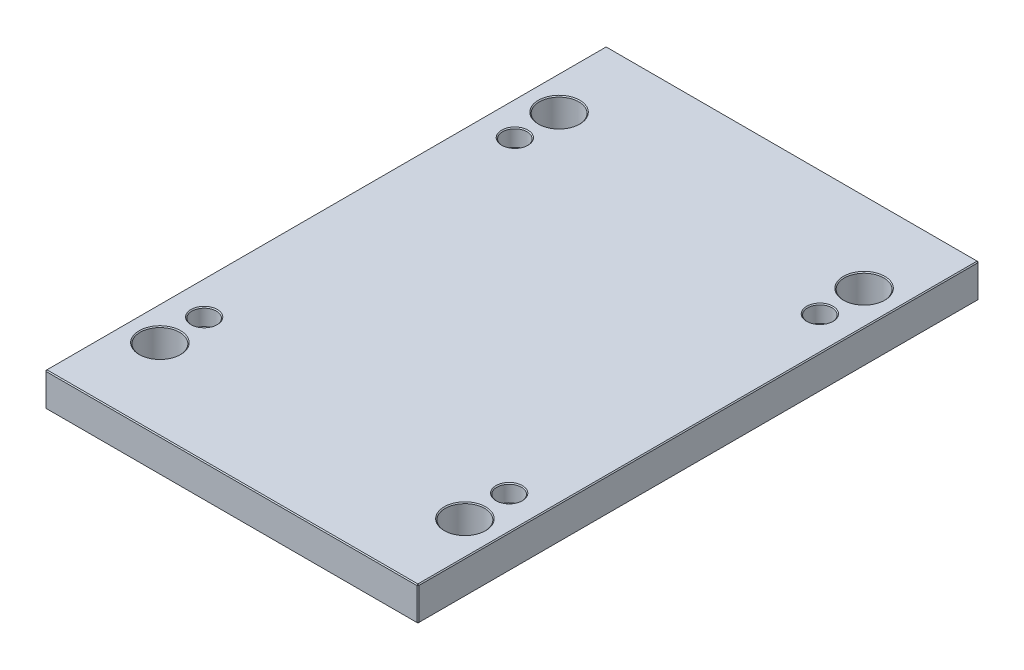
ISO-10303-21;
HEADER;
FILE_DESCRIPTION(('STEP AP214'),'2;1');
FILE_NAME('part.step','',(''),(''),'','','');
FILE_SCHEMA(('AUTOMOTIVE_DESIGN { 1 0 10303 214 1 1 1 1 }'));
ENDSEC;
DATA;
#1=APPLICATION_CONTEXT('core data for automotive mechanical design processes');
#2=APPLICATION_PROTOCOL_DEFINITION('international standard','automotive_design',2000,#1);
#3=PRODUCT_CONTEXT('',#1,'mechanical');
#4=PRODUCT('Part','Part','',(#3));
#5=PRODUCT_RELATED_PRODUCT_CATEGORY('part','',(#4));
#6=PRODUCT_DEFINITION_FORMATION('','',#4);
#7=PRODUCT_DEFINITION_CONTEXT('part definition',#1,'design');
#8=PRODUCT_DEFINITION('design','',#6,#7);
#9=PRODUCT_DEFINITION_SHAPE('','',#8);
#10=(LENGTH_UNIT() NAMED_UNIT(*) SI_UNIT(.MILLI.,.METRE.));
#11=(NAMED_UNIT(*) PLANE_ANGLE_UNIT() SI_UNIT($,.RADIAN.));
#12=(NAMED_UNIT(*) SI_UNIT($,.STERADIAN.) SOLID_ANGLE_UNIT());
#13=UNCERTAINTY_MEASURE_WITH_UNIT(LENGTH_MEASURE(1.E-05),#10,'distance_accuracy_value','');
#14=(GEOMETRIC_REPRESENTATION_CONTEXT(3) GLOBAL_UNCERTAINTY_ASSIGNED_CONTEXT((#13)) GLOBAL_UNIT_ASSIGNED_CONTEXT((#10,
#11,#12)) REPRESENTATION_CONTEXT('',''));
#15=CARTESIAN_POINT('',(0.,0.,0.));
#16=DIRECTION('',(0.,0.,1.));
#17=DIRECTION('',(1.,0.,0.));
#18=AXIS2_PLACEMENT_3D('',#15,#16,#17);
#19=CARTESIAN_POINT('',(-198.,36.,298.));
#20=DIRECTION('',(1.,0.,0.));
#21=DIRECTION('',(0.,0.,-1.));
#22=AXIS2_PLACEMENT_3D('',#19,#20,#21);
#23=PLANE('',#22);
#24=DIRECTION('',(0.,-1.,0.));
#25=VECTOR('',#24,1.);
#26=CARTESIAN_POINT('',(-198.,36.,-297.));
#27=LINE('',#26,#25);
#28=CARTESIAN_POINT('',(-198.,35.,-297.));
#29=VERTEX_POINT('',#28);
#30=CARTESIAN_POINT('',(-198.,1.,-297.));
#31=VERTEX_POINT('',#30);
#32=EDGE_CURVE('E115',#29,#31,#27,.T.);
#33=ORIENTED_EDGE('',*,*,#32,.T.);
#34=DIRECTION('',(0.,0.,1.));
#35=VECTOR('',#34,1.);
#36=CARTESIAN_POINT('',(-198.,1.,298.));
#37=LINE('',#36,#35);
#38=CARTESIAN_POINT('',(-198.,1.,297.));
#39=VERTEX_POINT('',#38);
#40=EDGE_CURVE('E111',#31,#39,#37,.T.);
#41=ORIENTED_EDGE('',*,*,#40,.T.);
#42=DIRECTION('',(0.,1.,0.));
#43=VECTOR('',#42,1.);
#44=CARTESIAN_POINT('',(-198.,36.,297.));
#45=LINE('',#44,#43);
#46=CARTESIAN_POINT('',(-198.,35.,297.));
#47=VERTEX_POINT('',#46);
#48=EDGE_CURVE('E104',#39,#47,#45,.T.);
#49=ORIENTED_EDGE('',*,*,#48,.T.);
#50=DIRECTION('',(0.,0.,-1.));
#51=VECTOR('',#50,1.);
#52=CARTESIAN_POINT('',(-198.,35.,-298.));
#53=LINE('',#52,#51);
#54=EDGE_CURVE('E108',#47,#29,#53,.T.);
#55=ORIENTED_EDGE('',*,*,#54,.T.);
#56=EDGE_LOOP('',(#33,#41,#49,#55));
#57=FACE_BOUND('',#56,.T.);
#58=ADVANCED_FACE('F16',(#57),#23,.F.);
#59=CARTESIAN_POINT('',(198.,36.,298.));
#60=DIRECTION('',(0.,0.,-1.));
#61=DIRECTION('',(-1.,0.,0.));
#62=AXIS2_PLACEMENT_3D('',#59,#60,#61);
#63=PLANE('',#62);
#64=DIRECTION('',(-1.,0.,0.));
#65=VECTOR('',#64,1.);
#66=CARTESIAN_POINT('',(-198.,35.,298.));
#67=LINE('',#66,#65);
#68=CARTESIAN_POINT('',(197.,35.,298.));
#69=VERTEX_POINT('',#68);
#70=CARTESIAN_POINT('',(-197.,35.,298.));
#71=VERTEX_POINT('',#70);
#72=EDGE_CURVE('E170',#69,#71,#67,.T.);
#73=ORIENTED_EDGE('',*,*,#72,.T.);
#74=DIRECTION('',(0.,-1.,0.));
#75=VECTOR('',#74,1.);
#76=CARTESIAN_POINT('',(-197.,36.,298.));
#77=LINE('',#76,#75);
#78=CARTESIAN_POINT('',(-197.,1.,298.));
#79=VERTEX_POINT('',#78);
#80=EDGE_CURVE('E123',#71,#79,#77,.T.);
#81=ORIENTED_EDGE('',*,*,#80,.T.);
#82=DIRECTION('',(1.,0.,0.));
#83=VECTOR('',#82,1.);
#84=CARTESIAN_POINT('',(198.,1.,298.));
#85=LINE('',#84,#83);
#86=CARTESIAN_POINT('',(197.,1.,298.));
#87=VERTEX_POINT('',#86);
#88=EDGE_CURVE('E174',#79,#87,#85,.T.);
#89=ORIENTED_EDGE('',*,*,#88,.T.);
#90=DIRECTION('',(0.,1.,0.));
#91=VECTOR('',#90,1.);
#92=CARTESIAN_POINT('',(197.,36.,298.));
#93=LINE('',#92,#91);
#94=EDGE_CURVE('E172',#87,#69,#93,.T.);
#95=ORIENTED_EDGE('',*,*,#94,.T.);
#96=EDGE_LOOP('',(#73,#81,#89,#95));
#97=FACE_BOUND('',#96,.T.);
#98=ADVANCED_FACE('F413',(#97),#63,.F.);
#99=CARTESIAN_POINT('',(198.,36.,298.));
#100=DIRECTION('',(-1.,0.,0.));
#101=DIRECTION('',(0.,0.,1.));
#102=AXIS2_PLACEMENT_3D('',#99,#100,#101);
#103=PLANE('',#102);
#104=DIRECTION('',(0.,0.,-1.));
#105=VECTOR('',#104,1.);
#106=CARTESIAN_POINT('',(198.,1.,298.));
#107=LINE('',#106,#105);
#108=CARTESIAN_POINT('',(198.,1.,297.));
#109=VERTEX_POINT('',#108);
#110=CARTESIAN_POINT('',(198.,1.,-297.));
#111=VERTEX_POINT('',#110);
#112=EDGE_CURVE('E165',#109,#111,#107,.T.);
#113=ORIENTED_EDGE('',*,*,#112,.T.);
#114=DIRECTION('',(0.,1.,0.));
#115=VECTOR('',#114,1.);
#116=CARTESIAN_POINT('',(198.,36.,-297.));
#117=LINE('',#116,#115);
#118=CARTESIAN_POINT('',(198.,35.,-297.));
#119=VERTEX_POINT('',#118);
#120=EDGE_CURVE('E167',#111,#119,#117,.T.);
#121=ORIENTED_EDGE('',*,*,#120,.T.);
#122=DIRECTION('',(0.,0.,1.));
#123=VECTOR('',#122,1.);
#124=CARTESIAN_POINT('',(198.,35.,298.));
#125=LINE('',#124,#123);
#126=CARTESIAN_POINT('',(198.,35.,297.));
#127=VERTEX_POINT('',#126);
#128=EDGE_CURVE('E161',#119,#127,#125,.T.);
#129=ORIENTED_EDGE('',*,*,#128,.T.);
#130=DIRECTION('',(0.,-1.,0.));
#131=VECTOR('',#130,1.);
#132=CARTESIAN_POINT('',(198.,36.,297.));
#133=LINE('',#132,#131);
#134=EDGE_CURVE('E163',#127,#109,#133,.T.);
#135=ORIENTED_EDGE('',*,*,#134,.T.);
#136=EDGE_LOOP('',(#113,#121,#129,#135));
#137=FACE_BOUND('',#136,.T.);
#138=ADVANCED_FACE('F406',(#137),#103,.F.);
#139=CARTESIAN_POINT('',(198.,36.,-298.));
#140=DIRECTION('',(0.,0.,1.));
#141=DIRECTION('',(1.,0.,0.));
#142=AXIS2_PLACEMENT_3D('',#139,#140,#141);
#143=PLANE('',#142);
#144=DIRECTION('',(0.,-1.,0.));
#145=VECTOR('',#144,1.);
#146=CARTESIAN_POINT('',(197.,36.,-298.));
#147=LINE('',#146,#145);
#148=CARTESIAN_POINT('',(197.,35.,-298.));
#149=VERTEX_POINT('',#148);
#150=CARTESIAN_POINT('',(197.,1.,-298.));
#151=VERTEX_POINT('',#150);
#152=EDGE_CURVE('E154',#149,#151,#147,.T.);
#153=ORIENTED_EDGE('',*,*,#152,.T.);
#154=DIRECTION('',(-1.,0.,0.));
#155=VECTOR('',#154,1.);
#156=CARTESIAN_POINT('',(198.,1.,-298.));
#157=LINE('',#156,#155);
#158=CARTESIAN_POINT('',(-197.,1.,-298.));
#159=VERTEX_POINT('',#158);
#160=EDGE_CURVE('E159',#151,#159,#157,.T.);
#161=ORIENTED_EDGE('',*,*,#160,.T.);
#162=DIRECTION('',(0.,1.,0.));
#163=VECTOR('',#162,1.);
#164=CARTESIAN_POINT('',(-197.,36.,-298.));
#165=LINE('',#164,#163);
#166=CARTESIAN_POINT('',(-197.,35.,-298.));
#167=VERTEX_POINT('',#166);
#168=EDGE_CURVE('E156',#159,#167,#165,.T.);
#169=ORIENTED_EDGE('',*,*,#168,.T.);
#170=DIRECTION('',(1.,0.,0.));
#171=VECTOR('',#170,1.);
#172=CARTESIAN_POINT('',(198.,35.,-298.));
#173=LINE('',#172,#171);
#174=EDGE_CURVE('E152',#167,#149,#173,.T.);
#175=ORIENTED_EDGE('',*,*,#174,.T.);
#176=EDGE_LOOP('',(#153,#161,#169,#175));
#177=FACE_BOUND('',#176,.T.);
#178=ADVANCED_FACE('F431',(#177),#143,.F.);
#179=CARTESIAN_POINT('',(0.,36.,0.));
#180=DIRECTION('',(0.,1.,0.));
#181=DIRECTION('',(0.,0.,1.));
#182=AXIS2_PLACEMENT_3D('',#179,#180,#181);
#183=PLANE('',#182);
#184=CARTESIAN_POINT('',(-162.,36.,212.));
#185=DIRECTION('',(0.,1.,0.));
#186=DIRECTION('',(0.,0.,1.));
#187=AXIS2_PLACEMENT_3D('',#184,#185,#186);
#188=CIRCLE('',#187,22.);
#189=CARTESIAN_POINT('',(-162.,36.,234.));
#190=VERTEX_POINT('',#189);
#191=EDGE_CURVE('E317',#190,#190,#188,.F.);
#192=ORIENTED_EDGE('',*,*,#191,.T.);
#193=EDGE_LOOP('',(#192));
#194=FACE_BOUND('',#193,.T.);
#195=CARTESIAN_POINT('',(162.,36.,212.));
#196=DIRECTION('',(0.,1.,0.));
#197=DIRECTION('',(0.,0.,1.));
#198=AXIS2_PLACEMENT_3D('',#195,#196,#197);
#199=CIRCLE('',#198,22.);
#200=CARTESIAN_POINT('',(162.,36.,234.));
#201=VERTEX_POINT('',#200);
#202=EDGE_CURVE('E314',#201,#201,#199,.F.);
#203=ORIENTED_EDGE('',*,*,#202,.T.);
#204=EDGE_LOOP('',(#203));
#205=FACE_BOUND('',#204,.T.);
#206=CARTESIAN_POINT('',(162.,36.,-212.));
#207=DIRECTION('',(0.,1.,0.));
#208=DIRECTION('',(0.,0.,1.));
#209=AXIS2_PLACEMENT_3D('',#206,#207,#208);
#210=CIRCLE('',#209,22.);
#211=CARTESIAN_POINT('',(162.,36.,-190.));
#212=VERTEX_POINT('',#211);
#213=EDGE_CURVE('E311',#212,#212,#210,.F.);
#214=ORIENTED_EDGE('',*,*,#213,.T.);
#215=EDGE_LOOP('',(#214));
#216=FACE_BOUND('',#215,.T.);
#217=CARTESIAN_POINT('',(-162.,36.,-212.));
#218=DIRECTION('',(0.,1.,0.));
#219=DIRECTION('',(0.,0.,1.));
#220=AXIS2_PLACEMENT_3D('',#217,#218,#219);
#221=CIRCLE('',#220,22.);
#222=CARTESIAN_POINT('',(-162.,36.,-190.));
#223=VERTEX_POINT('',#222);
#224=EDGE_CURVE('E308',#223,#223,#221,.F.);
#225=ORIENTED_EDGE('',*,*,#224,.T.);
#226=EDGE_LOOP('',(#225));
#227=FACE_BOUND('',#226,.T.);
#228=CARTESIAN_POINT('',(-162.,36.,165.));
#229=DIRECTION('',(0.,1.,0.));
#230=DIRECTION('',(0.,0.,1.));
#231=AXIS2_PLACEMENT_3D('',#228,#229,#230);
#232=CIRCLE('',#231,14.0000000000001);
#233=CARTESIAN_POINT('',(-162.,36.,179.));
#234=VERTEX_POINT('',#233);
#235=EDGE_CURVE('E290',#234,#234,#232,.F.);
#236=ORIENTED_EDGE('',*,*,#235,.T.);
#237=EDGE_LOOP('',(#236));
#238=FACE_BOUND('',#237,.T.);
#239=CARTESIAN_POINT('',(162.,36.,165.));
#240=DIRECTION('',(0.,1.,0.));
#241=DIRECTION('',(0.,0.,1.));
#242=AXIS2_PLACEMENT_3D('',#239,#240,#241);
#243=CIRCLE('',#242,14.0000000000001);
#244=CARTESIAN_POINT('',(162.,36.,179.));
#245=VERTEX_POINT('',#244);
#246=EDGE_CURVE('E287',#245,#245,#243,.F.);
#247=ORIENTED_EDGE('',*,*,#246,.T.);
#248=EDGE_LOOP('',(#247));
#249=FACE_BOUND('',#248,.T.);
#250=CARTESIAN_POINT('',(162.,36.,-165.));
#251=DIRECTION('',(0.,1.,0.));
#252=DIRECTION('',(0.,0.,1.));
#253=AXIS2_PLACEMENT_3D('',#250,#251,#252);
#254=CIRCLE('',#253,14.0000000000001);
#255=CARTESIAN_POINT('',(162.,36.,-151.));
#256=VERTEX_POINT('',#255);
#257=EDGE_CURVE('E284',#256,#256,#254,.F.);
#258=ORIENTED_EDGE('',*,*,#257,.T.);
#259=EDGE_LOOP('',(#258));
#260=FACE_BOUND('',#259,.T.);
#261=CARTESIAN_POINT('',(-162.,36.,-165.));
#262=DIRECTION('',(0.,1.,0.));
#263=DIRECTION('',(0.,0.,1.));
#264=AXIS2_PLACEMENT_3D('',#261,#262,#263);
#265=CIRCLE('',#264,14.);
#266=CARTESIAN_POINT('',(-162.,36.,-151.));
#267=VERTEX_POINT('',#266);
#268=EDGE_CURVE('E281',#267,#267,#265,.F.);
#269=ORIENTED_EDGE('',*,*,#268,.T.);
#270=EDGE_LOOP('',(#269));
#271=FACE_BOUND('',#270,.T.);
#272=DIRECTION('',(0.,0.,-1.));
#273=VECTOR('',#272,1.);
#274=CARTESIAN_POINT('',(197.,36.,-298.));
#275=LINE('',#274,#273);
#276=CARTESIAN_POINT('',(197.,36.,297.));
#277=VERTEX_POINT('',#276);
#278=CARTESIAN_POINT('',(197.,36.,-297.));
#279=VERTEX_POINT('',#278);
#280=EDGE_CURVE('E31',#277,#279,#275,.T.);
#281=ORIENTED_EDGE('',*,*,#280,.T.);
#282=DIRECTION('',(-1.,0.,0.));
#283=VECTOR('',#282,1.);
#284=CARTESIAN_POINT('',(-198.,36.,-297.));
#285=LINE('',#284,#283);
#286=CARTESIAN_POINT('',(-197.,36.,-297.));
#287=VERTEX_POINT('',#286);
#288=EDGE_CURVE('E190',#279,#287,#285,.T.);
#289=ORIENTED_EDGE('',*,*,#288,.T.);
#290=DIRECTION('',(0.,0.,1.));
#291=VECTOR('',#290,1.);
#292=CARTESIAN_POINT('',(-197.,36.,298.));
#293=LINE('',#292,#291);
#294=CARTESIAN_POINT('',(-197.,36.,297.));
#295=VERTEX_POINT('',#294);
#296=EDGE_CURVE('E186',#287,#295,#293,.T.);
#297=ORIENTED_EDGE('',*,*,#296,.T.);
#298=DIRECTION('',(1.,0.,0.));
#299=VECTOR('',#298,1.);
#300=CARTESIAN_POINT('',(198.,36.,297.));
#301=LINE('',#300,#299);
#302=EDGE_CURVE('E36',#295,#277,#301,.T.);
#303=ORIENTED_EDGE('',*,*,#302,.T.);
#304=EDGE_LOOP('',(#281,#289,#297,#303));
#305=FACE_BOUND('',#304,.T.);
#306=ADVANCED_FACE('F357',(#194,#205,#216,#227,#238,#249,#260,#271,#305),#183,.T.);
#307=CARTESIAN_POINT('',(0.,0.,0.));
#308=DIRECTION('',(0.,1.,0.));
#309=DIRECTION('',(0.,0.,1.));
#310=AXIS2_PLACEMENT_3D('',#307,#308,#309);
#311=PLANE('',#310);
#312=CARTESIAN_POINT('',(-162.,0.,212.));
#313=DIRECTION('',(0.,1.,0.));
#314=DIRECTION('',(0.,0.,1.));
#315=AXIS2_PLACEMENT_3D('',#312,#313,#314);
#316=CIRCLE('',#315,22.);
#317=CARTESIAN_POINT('',(-162.,0.,234.));
#318=VERTEX_POINT('',#317);
#319=EDGE_CURVE('E329',#318,#318,#316,.T.);
#320=ORIENTED_EDGE('',*,*,#319,.T.);
#321=EDGE_LOOP('',(#320));
#322=FACE_BOUND('',#321,.T.);
#323=CARTESIAN_POINT('',(162.,0.,212.));
#324=DIRECTION('',(0.,1.,0.));
#325=DIRECTION('',(0.,0.,1.));
#326=AXIS2_PLACEMENT_3D('',#323,#324,#325);
#327=CIRCLE('',#326,22.);
#328=CARTESIAN_POINT('',(162.,0.,234.));
#329=VERTEX_POINT('',#328);
#330=EDGE_CURVE('E326',#329,#329,#327,.T.);
#331=ORIENTED_EDGE('',*,*,#330,.T.);
#332=EDGE_LOOP('',(#331));
#333=FACE_BOUND('',#332,.T.);
#334=CARTESIAN_POINT('',(162.,0.,-212.));
#335=DIRECTION('',(0.,1.,0.));
#336=DIRECTION('',(0.,0.,1.));
#337=AXIS2_PLACEMENT_3D('',#334,#335,#336);
#338=CIRCLE('',#337,22.);
#339=CARTESIAN_POINT('',(162.,0.,-190.));
#340=VERTEX_POINT('',#339);
#341=EDGE_CURVE('E323',#340,#340,#338,.T.);
#342=ORIENTED_EDGE('',*,*,#341,.T.);
#343=EDGE_LOOP('',(#342));
#344=FACE_BOUND('',#343,.T.);
#345=CARTESIAN_POINT('',(-162.,0.,-212.));
#346=DIRECTION('',(0.,1.,0.));
#347=DIRECTION('',(0.,0.,1.));
#348=AXIS2_PLACEMENT_3D('',#345,#346,#347);
#349=CIRCLE('',#348,22.);
#350=CARTESIAN_POINT('',(-162.,0.,-190.));
#351=VERTEX_POINT('',#350);
#352=EDGE_CURVE('E320',#351,#351,#349,.T.);
#353=ORIENTED_EDGE('',*,*,#352,.T.);
#354=EDGE_LOOP('',(#353));
#355=FACE_BOUND('',#354,.T.);
#356=CARTESIAN_POINT('',(162.,0.,-165.));
#357=DIRECTION('',(0.,1.,0.));
#358=DIRECTION('',(0.,0.,1.));
#359=AXIS2_PLACEMENT_3D('',#356,#357,#358);
#360=CIRCLE('',#359,10.);
#361=CARTESIAN_POINT('',(162.,0.,-155.));
#362=VERTEX_POINT('',#361);
#363=EDGE_CURVE('E263',#362,#362,#360,.T.);
#364=ORIENTED_EDGE('',*,*,#363,.T.);
#365=EDGE_LOOP('',(#364));
#366=FACE_BOUND('',#365,.T.);
#367=CARTESIAN_POINT('',(162.,0.,165.));
#368=DIRECTION('',(0.,1.,0.));
#369=DIRECTION('',(0.,0.,1.));
#370=AXIS2_PLACEMENT_3D('',#367,#368,#369);
#371=CIRCLE('',#370,10.);
#372=CARTESIAN_POINT('',(162.,0.,175.));
#373=VERTEX_POINT('',#372);
#374=EDGE_CURVE('E260',#373,#373,#371,.T.);
#375=ORIENTED_EDGE('',*,*,#374,.T.);
#376=EDGE_LOOP('',(#375));
#377=FACE_BOUND('',#376,.T.);
#378=CARTESIAN_POINT('',(-162.,0.,165.));
#379=DIRECTION('',(0.,1.,0.));
#380=DIRECTION('',(0.,0.,1.));
#381=AXIS2_PLACEMENT_3D('',#378,#379,#380);
#382=CIRCLE('',#381,10.);
#383=CARTESIAN_POINT('',(-162.,0.,175.));
#384=VERTEX_POINT('',#383);
#385=EDGE_CURVE('E257',#384,#384,#382,.T.);
#386=ORIENTED_EDGE('',*,*,#385,.T.);
#387=EDGE_LOOP('',(#386));
#388=FACE_BOUND('',#387,.T.);
#389=CARTESIAN_POINT('',(-162.,0.,-165.));
#390=DIRECTION('',(0.,1.,0.));
#391=DIRECTION('',(0.,0.,1.));
#392=AXIS2_PLACEMENT_3D('',#389,#390,#391);
#393=CIRCLE('',#392,10.);
#394=CARTESIAN_POINT('',(-162.,0.,-155.));
#395=VERTEX_POINT('',#394);
#396=EDGE_CURVE('E192',#395,#395,#393,.T.);
#397=ORIENTED_EDGE('',*,*,#396,.T.);
#398=EDGE_LOOP('',(#397));
#399=FACE_BOUND('',#398,.T.);
#400=DIRECTION('',(0.,0.,1.));
#401=VECTOR('',#400,1.);
#402=CARTESIAN_POINT('',(197.,0.,0.));
#403=LINE('',#402,#401);
#404=CARTESIAN_POINT('',(197.,0.,-297.));
#405=VERTEX_POINT('',#404);
#406=CARTESIAN_POINT('',(197.,0.,297.));
#407=VERTEX_POINT('',#406);
#408=EDGE_CURVE('E177',#405,#407,#403,.T.);
#409=ORIENTED_EDGE('',*,*,#408,.T.);
#410=DIRECTION('',(-1.,0.,0.));
#411=VECTOR('',#410,1.);
#412=CARTESIAN_POINT('',(0.,0.,297.));
#413=LINE('',#412,#411);
#414=CARTESIAN_POINT('',(-197.,0.,297.));
#415=VERTEX_POINT('',#414);
#416=EDGE_CURVE('E183',#407,#415,#413,.T.);
#417=ORIENTED_EDGE('',*,*,#416,.T.);
#418=DIRECTION('',(0.,0.,-1.));
#419=VECTOR('',#418,1.);
#420=CARTESIAN_POINT('',(-197.,0.,0.));
#421=LINE('',#420,#419);
#422=CARTESIAN_POINT('',(-197.,0.,-297.));
#423=VERTEX_POINT('',#422);
#424=EDGE_CURVE('E181',#415,#423,#421,.T.);
#425=ORIENTED_EDGE('',*,*,#424,.T.);
#426=DIRECTION('',(1.,0.,0.));
#427=VECTOR('',#426,1.);
#428=CARTESIAN_POINT('',(0.,0.,-297.));
#429=LINE('',#428,#427);
#430=EDGE_CURVE('E179',#423,#405,#429,.T.);
#431=ORIENTED_EDGE('',*,*,#430,.T.);
#432=EDGE_LOOP('',(#409,#417,#425,#431));
#433=FACE_BOUND('',#432,.T.);
#434=ADVANCED_FACE('F353',(#322,#333,#344,#355,#366,#377,#388,#399,#433),#311,.F.);
#435=CARTESIAN_POINT('',(198.,36.,297.));
#436=DIRECTION('',(-0.707106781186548,0.,-0.707106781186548));
#437=DIRECTION('',(0.,-1.,0.));
#438=AXIS2_PLACEMENT_3D('',#435,#436,#437);
#439=PLANE('',#438);
#440=DIRECTION('',(-0.707106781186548,0.,0.707106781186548));
#441=VECTOR('',#440,1.);
#442=CARTESIAN_POINT('',(197.,35.,298.));
#443=LINE('',#442,#441);
#444=EDGE_CURVE('E141',#69,#127,#443,.F.);
#445=ORIENTED_EDGE('',*,*,#444,.F.);
#446=ORIENTED_EDGE('',*,*,#94,.F.);
#447=DIRECTION('',(0.707106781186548,0.,-0.707106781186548));
#448=VECTOR('',#447,1.);
#449=CARTESIAN_POINT('',(197.,1.,298.));
#450=LINE('',#449,#448);
#451=EDGE_CURVE('E144',#109,#87,#450,.F.);
#452=ORIENTED_EDGE('',*,*,#451,.F.);
#453=ORIENTED_EDGE('',*,*,#134,.F.);
#454=EDGE_LOOP('',(#445,#446,#452,#453));
#455=FACE_BOUND('',#454,.T.);
#456=ADVANCED_FACE('F356',(#455),#439,.F.);
#457=CARTESIAN_POINT('',(197.,35.,298.));
#458=DIRECTION('',(0.577350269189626,0.577350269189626,0.577350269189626));
#459=DIRECTION('',(0.707106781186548,0.,-0.707106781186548));
#460=AXIS2_PLACEMENT_3D('',#457,#458,#459);
#461=PLANE('',#460);
#462=DIRECTION('',(0.,-0.707106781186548,0.707106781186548));
#463=VECTOR('',#462,1.);
#464=CARTESIAN_POINT('',(197.,35.,298.));
#465=LINE('',#464,#463);
#466=EDGE_CURVE('E235',#69,#277,#465,.F.);
#467=ORIENTED_EDGE('',*,*,#466,.F.);
#468=ORIENTED_EDGE('',*,*,#444,.T.);
#469=DIRECTION('',(-0.707106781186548,0.707106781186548,0.));
#470=VECTOR('',#469,1.);
#471=CARTESIAN_POINT('',(197.5,35.5,297.));
#472=LINE('',#471,#470);
#473=EDGE_CURVE('E237',#277,#127,#472,.F.);
#474=ORIENTED_EDGE('',*,*,#473,.F.);
#475=EDGE_LOOP('',(#467,#468,#474));
#476=FACE_BOUND('',#475,.T.);
#477=ADVANCED_FACE('F419',(#476),#461,.T.);
#478=CARTESIAN_POINT('',(197.,1.,298.));
#479=DIRECTION('',(0.577350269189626,-0.577350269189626,0.577350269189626));
#480=DIRECTION('',(0.707106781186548,0.,-0.707106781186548));
#481=AXIS2_PLACEMENT_3D('',#478,#479,#480);
#482=PLANE('',#481);
#483=DIRECTION('',(-0.707106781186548,-0.707106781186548,0.));
#484=VECTOR('',#483,1.);
#485=CARTESIAN_POINT('',(197.5,0.5,297.));
#486=LINE('',#485,#484);
#487=EDGE_CURVE('E229',#109,#407,#486,.T.);
#488=ORIENTED_EDGE('',*,*,#487,.F.);
#489=ORIENTED_EDGE('',*,*,#451,.T.);
#490=DIRECTION('',(0.,0.707106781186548,0.707106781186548));
#491=VECTOR('',#490,1.);
#492=CARTESIAN_POINT('',(197.,1.,298.));
#493=LINE('',#492,#491);
#494=EDGE_CURVE('E232',#407,#87,#493,.T.);
#495=ORIENTED_EDGE('',*,*,#494,.F.);
#496=EDGE_LOOP('',(#488,#489,#495));
#497=FACE_BOUND('',#496,.T.);
#498=ADVANCED_FACE('F378',(#497),#482,.T.);
#499=CARTESIAN_POINT('',(197.,36.,0.));
#500=DIRECTION('',(0.707106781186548,0.707106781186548,0.));
#501=DIRECTION('',(0.,0.,1.));
#502=AXIS2_PLACEMENT_3D('',#499,#500,#501);
#503=PLANE('',#502);
#504=ORIENTED_EDGE('',*,*,#473,.T.);
#505=ORIENTED_EDGE('',*,*,#128,.F.);
#506=DIRECTION('',(0.707106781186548,-0.707106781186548,0.));
#507=VECTOR('',#506,1.);
#508=CARTESIAN_POINT('',(198.,35.,-297.));
#509=LINE('',#508,#507);
#510=EDGE_CURVE('E224',#279,#119,#509,.T.);
#511=ORIENTED_EDGE('',*,*,#510,.F.);
#512=ORIENTED_EDGE('',*,*,#280,.F.);
#513=EDGE_LOOP('',(#504,#505,#511,#512));
#514=FACE_BOUND('',#513,.T.);
#515=ADVANCED_FACE('F421',(#514),#503,.T.);
#516=CARTESIAN_POINT('',(0.,36.,297.));
#517=DIRECTION('',(0.,0.707106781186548,0.707106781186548));
#518=DIRECTION('',(-1.,0.,0.));
#519=AXIS2_PLACEMENT_3D('',#516,#517,#518);
#520=PLANE('',#519);
#521=ORIENTED_EDGE('',*,*,#466,.T.);
#522=ORIENTED_EDGE('',*,*,#302,.F.);
#523=DIRECTION('',(0.,0.707106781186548,-0.707106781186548));
#524=VECTOR('',#523,1.);
#525=CARTESIAN_POINT('',(-197.,35.5,297.5));
#526=LINE('',#525,#524);
#527=EDGE_CURVE('E127',#71,#295,#526,.T.);
#528=ORIENTED_EDGE('',*,*,#527,.F.);
#529=ORIENTED_EDGE('',*,*,#72,.F.);
#530=EDGE_LOOP('',(#521,#522,#528,#529));
#531=FACE_BOUND('',#530,.T.);
#532=ADVANCED_FACE('F416',(#531),#520,.T.);
#533=CARTESIAN_POINT('',(-197.,36.,298.));
#534=DIRECTION('',(0.707106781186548,0.,-0.707106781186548));
#535=DIRECTION('',(0.,-1.,0.));
#536=AXIS2_PLACEMENT_3D('',#533,#534,#535);
#537=PLANE('',#536);
#538=DIRECTION('',(0.707106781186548,0.,0.707106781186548));
#539=VECTOR('',#538,1.);
#540=CARTESIAN_POINT('',(-197.,1.,298.));
#541=LINE('',#540,#539);
#542=EDGE_CURVE('E128',#79,#39,#541,.F.);
#543=ORIENTED_EDGE('',*,*,#542,.F.);
#544=ORIENTED_EDGE('',*,*,#80,.F.);
#545=DIRECTION('',(-0.707106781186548,0.,-0.707106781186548));
#546=VECTOR('',#545,1.);
#547=CARTESIAN_POINT('',(-198.,35.,297.));
#548=LINE('',#547,#546);
#549=EDGE_CURVE('E119',#47,#71,#548,.F.);
#550=ORIENTED_EDGE('',*,*,#549,.F.);
#551=ORIENTED_EDGE('',*,*,#48,.F.);
#552=EDGE_LOOP('',(#543,#544,#550,#551));
#553=FACE_BOUND('',#552,.T.);
#554=ADVANCED_FACE('F121',(#553),#537,.F.);
#555=CARTESIAN_POINT('',(198.,1.,298.));
#556=DIRECTION('',(0.,0.707106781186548,-0.707106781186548));
#557=DIRECTION('',(1.,0.,0.));
#558=AXIS2_PLACEMENT_3D('',#555,#556,#557);
#559=PLANE('',#558);
#560=ORIENTED_EDGE('',*,*,#494,.T.);
#561=ORIENTED_EDGE('',*,*,#88,.F.);
#562=DIRECTION('',(0.,-0.707106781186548,-0.707106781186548));
#563=VECTOR('',#562,1.);
#564=CARTESIAN_POINT('',(-197.,1.,298.));
#565=LINE('',#564,#563);
#566=EDGE_CURVE('E220',#415,#79,#565,.F.);
#567=ORIENTED_EDGE('',*,*,#566,.F.);
#568=ORIENTED_EDGE('',*,*,#416,.F.);
#569=EDGE_LOOP('',(#560,#561,#567,#568));
#570=FACE_BOUND('',#569,.T.);
#571=ADVANCED_FACE('F383',(#570),#559,.F.);
#572=CARTESIAN_POINT('',(198.,1.,298.));
#573=DIRECTION('',(-0.707106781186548,0.707106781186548,0.));
#574=DIRECTION('',(0.,0.,-1.));
#575=AXIS2_PLACEMENT_3D('',#572,#573,#574);
#576=PLANE('',#575);
#577=ORIENTED_EDGE('',*,*,#487,.T.);
#578=ORIENTED_EDGE('',*,*,#408,.F.);
#579=DIRECTION('',(0.707106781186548,0.707106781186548,0.));
#580=VECTOR('',#579,1.);
#581=CARTESIAN_POINT('',(197.5,0.500000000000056,-297.));
#582=LINE('',#581,#580);
#583=EDGE_CURVE('E217',#111,#405,#582,.F.);
#584=ORIENTED_EDGE('',*,*,#583,.F.);
#585=ORIENTED_EDGE('',*,*,#112,.F.);
#586=EDGE_LOOP('',(#577,#578,#584,#585));
#587=FACE_BOUND('',#586,.T.);
#588=ADVANCED_FACE('F376',(#587),#576,.F.);
#589=CARTESIAN_POINT('',(197.,36.,-298.));
#590=DIRECTION('',(-0.707106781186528,0.,0.707106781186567));
#591=DIRECTION('',(0.,-1.,0.));
#592=AXIS2_PLACEMENT_3D('',#589,#590,#591);
#593=PLANE('',#592);
#594=DIRECTION('',(0.707106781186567,0.,0.707106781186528));
#595=VECTOR('',#594,1.);
#596=CARTESIAN_POINT('',(198.,35.,-297.));
#597=LINE('',#596,#595);
#598=EDGE_CURVE('E226',#119,#149,#597,.F.);
#599=ORIENTED_EDGE('',*,*,#598,.F.);
#600=ORIENTED_EDGE('',*,*,#120,.F.);
#601=DIRECTION('',(-0.707106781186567,0.,-0.707106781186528));
#602=VECTOR('',#601,1.);
#603=CARTESIAN_POINT('',(197.,1.,-298.));
#604=LINE('',#603,#602);
#605=EDGE_CURVE('E214',#151,#111,#604,.F.);
#606=ORIENTED_EDGE('',*,*,#605,.F.);
#607=ORIENTED_EDGE('',*,*,#152,.F.);
#608=EDGE_LOOP('',(#599,#600,#606,#607));
#609=FACE_BOUND('',#608,.T.);
#610=ADVANCED_FACE('F403',(#609),#593,.F.);
#611=CARTESIAN_POINT('',(198.,35.,-297.));
#612=DIRECTION('',(0.577350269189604,0.577350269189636,-0.577350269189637));
#613=DIRECTION('',(0.,0.707106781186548,0.707106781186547));
#614=AXIS2_PLACEMENT_3D('',#611,#612,#613);
#615=PLANE('',#614);
#616=ORIENTED_EDGE('',*,*,#510,.T.);
#617=ORIENTED_EDGE('',*,*,#598,.T.);
#618=DIRECTION('',(0.,0.707106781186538,0.707106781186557));
#619=VECTOR('',#618,1.);
#620=CARTESIAN_POINT('',(197.,35.5,-297.5));
#621=LINE('',#620,#619);
#622=EDGE_CURVE('E135',#279,#149,#621,.F.);
#623=ORIENTED_EDGE('',*,*,#622,.F.);
#624=EDGE_LOOP('',(#616,#617,#623));
#625=FACE_BOUND('',#624,.T.);
#626=ADVANCED_FACE('F425',(#625),#615,.T.);
#627=CARTESIAN_POINT('',(-198.,35.,297.));
#628=DIRECTION('',(-0.577350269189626,0.577350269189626,0.577350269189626));
#629=DIRECTION('',(0.707106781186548,0.,0.707106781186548));
#630=AXIS2_PLACEMENT_3D('',#627,#628,#629);
#631=PLANE('',#630);
#632=ORIENTED_EDGE('',*,*,#549,.T.);
#633=ORIENTED_EDGE('',*,*,#527,.T.);
#634=DIRECTION('',(-0.707106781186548,-0.707106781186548,0.));
#635=VECTOR('',#634,1.);
#636=CARTESIAN_POINT('',(-198.,35.,297.));
#637=LINE('',#636,#635);
#638=EDGE_CURVE('E131',#47,#295,#637,.F.);
#639=ORIENTED_EDGE('',*,*,#638,.F.);
#640=EDGE_LOOP('',(#632,#633,#639));
#641=FACE_BOUND('',#640,.T.);
#642=ADVANCED_FACE('F132',(#641),#631,.T.);
#643=CARTESIAN_POINT('',(-197.,1.,298.));
#644=DIRECTION('',(-0.577350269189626,-0.577350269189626,0.577350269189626));
#645=DIRECTION('',(0.707106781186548,0.,0.707106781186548));
#646=AXIS2_PLACEMENT_3D('',#643,#644,#645);
#647=PLANE('',#646);
#648=ORIENTED_EDGE('',*,*,#566,.T.);
#649=ORIENTED_EDGE('',*,*,#542,.T.);
#650=DIRECTION('',(-0.707106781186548,0.707106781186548,0.));
#651=VECTOR('',#650,1.);
#652=CARTESIAN_POINT('',(-197.5,0.5,297.));
#653=LINE('',#652,#651);
#654=EDGE_CURVE('E136',#415,#39,#653,.T.);
#655=ORIENTED_EDGE('',*,*,#654,.F.);
#656=EDGE_LOOP('',(#648,#649,#655));
#657=FACE_BOUND('',#656,.T.);
#658=ADVANCED_FACE('F386',(#657),#647,.T.);
#659=CARTESIAN_POINT('',(197.,1.,-298.));
#660=DIRECTION('',(0.577350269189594,-0.577350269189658,-0.577350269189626));
#661=DIRECTION('',(0.,0.707106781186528,-0.707106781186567));
#662=AXIS2_PLACEMENT_3D('',#659,#660,#661);
#663=PLANE('',#662);
#664=ORIENTED_EDGE('',*,*,#605,.T.);
#665=ORIENTED_EDGE('',*,*,#583,.T.);
#666=DIRECTION('',(0.,-0.707106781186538,0.707106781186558));
#667=VECTOR('',#666,1.);
#668=CARTESIAN_POINT('',(197.,1.,-298.));
#669=LINE('',#668,#667);
#670=EDGE_CURVE('E207',#151,#405,#669,.T.);
#671=ORIENTED_EDGE('',*,*,#670,.F.);
#672=EDGE_LOOP('',(#664,#665,#671));
#673=FACE_BOUND('',#672,.T.);
#674=ADVANCED_FACE('F397',(#673),#663,.T.);
#675=CARTESIAN_POINT('',(0.,36.,-297.));
#676=DIRECTION('',(0.,0.707106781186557,-0.707106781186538));
#677=DIRECTION('',(1.,0.,0.));
#678=AXIS2_PLACEMENT_3D('',#675,#676,#677);
#679=PLANE('',#678);
#680=ORIENTED_EDGE('',*,*,#622,.T.);
#681=ORIENTED_EDGE('',*,*,#174,.F.);
#682=DIRECTION('',(0.,-0.707106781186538,-0.707106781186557));
#683=VECTOR('',#682,1.);
#684=CARTESIAN_POINT('',(-197.,35.,-298.));
#685=LINE('',#684,#683);
#686=EDGE_CURVE('E204',#287,#167,#685,.T.);
#687=ORIENTED_EDGE('',*,*,#686,.F.);
#688=ORIENTED_EDGE('',*,*,#288,.F.);
#689=EDGE_LOOP('',(#680,#681,#687,#688));
#690=FACE_BOUND('',#689,.T.);
#691=ADVANCED_FACE('F429',(#690),#679,.T.);
#692=CARTESIAN_POINT('',(-197.,36.,0.));
#693=DIRECTION('',(-0.707106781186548,0.707106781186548,0.));
#694=DIRECTION('',(0.,0.,-1.));
#695=AXIS2_PLACEMENT_3D('',#692,#693,#694);
#696=PLANE('',#695);
#697=ORIENTED_EDGE('',*,*,#638,.T.);
#698=ORIENTED_EDGE('',*,*,#296,.F.);
#699=DIRECTION('',(0.707106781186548,0.707106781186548,0.));
#700=VECTOR('',#699,1.);
#701=CARTESIAN_POINT('',(-197.5,35.5,-297.));
#702=LINE('',#701,#700);
#703=EDGE_CURVE('E139',#29,#287,#702,.T.);
#704=ORIENTED_EDGE('',*,*,#703,.F.);
#705=ORIENTED_EDGE('',*,*,#54,.F.);
#706=EDGE_LOOP('',(#697,#698,#704,#705));
#707=FACE_BOUND('',#706,.T.);
#708=ADVANCED_FACE('F138',(#707),#696,.T.);
#709=CARTESIAN_POINT('',(-198.,1.,298.));
#710=DIRECTION('',(0.707106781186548,0.707106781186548,0.));
#711=DIRECTION('',(0.,0.,1.));
#712=AXIS2_PLACEMENT_3D('',#709,#710,#711);
#713=PLANE('',#712);
#714=ORIENTED_EDGE('',*,*,#654,.T.);
#715=ORIENTED_EDGE('',*,*,#40,.F.);
#716=DIRECTION('',(0.707106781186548,-0.707106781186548,1.17611407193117E-13));
#717=VECTOR('',#716,1.);
#718=CARTESIAN_POINT('',(-198.,1.,-297.));
#719=LINE('',#718,#717);
#720=EDGE_CURVE('E200',#423,#31,#719,.F.);
#721=ORIENTED_EDGE('',*,*,#720,.F.);
#722=ORIENTED_EDGE('',*,*,#424,.F.);
#723=EDGE_LOOP('',(#714,#715,#721,#722));
#724=FACE_BOUND('',#723,.T.);
#725=ADVANCED_FACE('F388',(#724),#713,.F.);
#726=CARTESIAN_POINT('',(198.,1.,-298.));
#727=DIRECTION('',(0.,0.707106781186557,0.707106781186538));
#728=DIRECTION('',(-1.,0.,0.));
#729=AXIS2_PLACEMENT_3D('',#726,#727,#728);
#730=PLANE('',#729);
#731=ORIENTED_EDGE('',*,*,#670,.T.);
#732=ORIENTED_EDGE('',*,*,#430,.F.);
#733=DIRECTION('',(0.,0.707106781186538,-0.707106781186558));
#734=VECTOR('',#733,1.);
#735=CARTESIAN_POINT('',(-197.,0.50000000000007,-297.5));
#736=LINE('',#735,#734);
#737=EDGE_CURVE('E197',#159,#423,#736,.F.);
#738=ORIENTED_EDGE('',*,*,#737,.F.);
#739=ORIENTED_EDGE('',*,*,#160,.F.);
#740=EDGE_LOOP('',(#731,#732,#738,#739));
#741=FACE_BOUND('',#740,.T.);
#742=ADVANCED_FACE('F392',(#741),#730,.F.);
#743=CARTESIAN_POINT('',(-197.,35.,-298.));
#744=DIRECTION('',(-0.577350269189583,0.577350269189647,-0.577350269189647));
#745=DIRECTION('',(0.,0.707106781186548,0.707106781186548));
#746=AXIS2_PLACEMENT_3D('',#743,#744,#745);
#747=PLANE('',#746);
#748=ORIENTED_EDGE('',*,*,#703,.T.);
#749=ORIENTED_EDGE('',*,*,#686,.T.);
#750=DIRECTION('',(0.707106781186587,0.,-0.707106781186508));
#751=VECTOR('',#750,1.);
#752=CARTESIAN_POINT('',(-197.,35.,-298.));
#753=LINE('',#752,#751);
#754=EDGE_CURVE('E195',#29,#167,#753,.T.);
#755=ORIENTED_EDGE('',*,*,#754,.F.);
#756=EDGE_LOOP('',(#748,#749,#755));
#757=FACE_BOUND('',#756,.T.);
#758=ADVANCED_FACE('F460',(#757),#747,.T.);
#759=CARTESIAN_POINT('',(-198.,1.,-297.));
#760=DIRECTION('',(-0.577350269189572,-0.577350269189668,-0.577350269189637));
#761=DIRECTION('',(0.,0.707106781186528,-0.707106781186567));
#762=AXIS2_PLACEMENT_3D('',#759,#760,#761);
#763=PLANE('',#762);
#764=ORIENTED_EDGE('',*,*,#737,.T.);
#765=ORIENTED_EDGE('',*,*,#720,.T.);
#766=DIRECTION('',(-0.707106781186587,0.,0.707106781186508));
#767=VECTOR('',#766,1.);
#768=CARTESIAN_POINT('',(-198.,1.,-297.));
#769=LINE('',#768,#767);
#770=EDGE_CURVE('E193',#159,#31,#769,.T.);
#771=ORIENTED_EDGE('',*,*,#770,.F.);
#772=EDGE_LOOP('',(#764,#765,#771));
#773=FACE_BOUND('',#772,.T.);
#774=ADVANCED_FACE('F456',(#773),#763,.T.);
#775=CARTESIAN_POINT('',(-198.,36.,-297.));
#776=DIRECTION('',(0.707106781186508,0.,0.707106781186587));
#777=DIRECTION('',(0.,-1.,0.));
#778=AXIS2_PLACEMENT_3D('',#775,#776,#777);
#779=PLANE('',#778);
#780=ORIENTED_EDGE('',*,*,#754,.T.);
#781=ORIENTED_EDGE('',*,*,#168,.F.);
#782=ORIENTED_EDGE('',*,*,#770,.T.);
#783=ORIENTED_EDGE('',*,*,#32,.F.);
#784=EDGE_LOOP('',(#780,#781,#782,#783));
#785=FACE_BOUND('',#784,.T.);
#786=ADVANCED_FACE('F452',(#785),#779,.F.);
#787=CARTESIAN_POINT('',(-162.,18.,-165.));
#788=DIRECTION('',(0.,1.,0.));
#789=DIRECTION('',(0.,0.,1.));
#790=AXIS2_PLACEMENT_3D('',#787,#788,#789);
#791=CYLINDRICAL_SURFACE('',#790,13.);
#792=CARTESIAN_POINT('',(-162.,35.,-165.));
#793=DIRECTION('',(0.,1.,0.));
#794=DIRECTION('',(0.,0.,1.));
#795=AXIS2_PLACEMENT_3D('',#792,#793,#794);
#796=CIRCLE('',#795,13.);
#797=CARTESIAN_POINT('',(-162.,35.,-152.));
#798=VERTEX_POINT('',#797);
#799=EDGE_CURVE('E299',#798,#798,#796,.T.);
#800=ORIENTED_EDGE('',*,*,#799,.T.);
#801=EDGE_LOOP('',(#800));
#802=FACE_BOUND('',#801,.T.);
#803=CARTESIAN_POINT('',(-162.,18.,-165.));
#804=DIRECTION('',(0.,1.,0.));
#805=DIRECTION('',(0.,0.,1.));
#806=AXIS2_PLACEMENT_3D('',#803,#804,#805);
#807=CIRCLE('',#806,13.);
#808=CARTESIAN_POINT('',(-162.,18.,-152.));
#809=VERTEX_POINT('',#808);
#810=EDGE_CURVE('E147',#809,#809,#807,.T.);
#811=ORIENTED_EDGE('',*,*,#810,.F.);
#812=EDGE_LOOP('',(#811));
#813=FACE_BOUND('',#812,.T.);
#814=ADVANCED_FACE('F455',(#802,#813),#791,.F.);
#815=CARTESIAN_POINT('',(-162.,18.,-165.));
#816=DIRECTION('',(0.,1.,0.));
#817=DIRECTION('',(0.,0.,1.));
#818=AXIS2_PLACEMENT_3D('',#815,#816,#817);
#819=PLANE('',#818);
#820=CARTESIAN_POINT('',(-162.,18.,-165.));
#821=DIRECTION('',(0.,1.,0.));
#822=DIRECTION('',(0.,0.,1.));
#823=AXIS2_PLACEMENT_3D('',#820,#821,#822);
#824=CIRCLE('',#823,9.);
#825=CARTESIAN_POINT('',(-162.,18.,-156.));
#826=VERTEX_POINT('',#825);
#827=EDGE_CURVE('E251',#826,#826,#824,.T.);
#828=ORIENTED_EDGE('',*,*,#827,.F.);
#829=EDGE_LOOP('',(#828));
#830=FACE_BOUND('',#829,.T.);
#831=ORIENTED_EDGE('',*,*,#810,.T.);
#832=EDGE_LOOP('',(#831));
#833=FACE_BOUND('',#832,.T.);
#834=ADVANCED_FACE('F602',(#830,#833),#819,.T.);
#835=CARTESIAN_POINT('',(162.,18.,-165.));
#836=DIRECTION('',(0.,1.,0.));
#837=DIRECTION('',(0.,0.,1.));
#838=AXIS2_PLACEMENT_3D('',#835,#836,#837);
#839=CYLINDRICAL_SURFACE('',#838,13.);
#840=CARTESIAN_POINT('',(162.,35.,-165.));
#841=DIRECTION('',(0.,1.,0.));
#842=DIRECTION('',(0.,0.,1.));
#843=AXIS2_PLACEMENT_3D('',#840,#841,#842);
#844=CIRCLE('',#843,13.);
#845=CARTESIAN_POINT('',(162.,35.,-152.));
#846=VERTEX_POINT('',#845);
#847=EDGE_CURVE('E296',#846,#846,#844,.T.);
#848=ORIENTED_EDGE('',*,*,#847,.T.);
#849=EDGE_LOOP('',(#848));
#850=FACE_BOUND('',#849,.T.);
#851=CARTESIAN_POINT('',(162.,18.,-165.));
#852=DIRECTION('',(0.,1.,0.));
#853=DIRECTION('',(0.,0.,1.));
#854=AXIS2_PLACEMENT_3D('',#851,#852,#853);
#855=CIRCLE('',#854,13.);
#856=CARTESIAN_POINT('',(162.,18.,-152.));
#857=VERTEX_POINT('',#856);
#858=EDGE_CURVE('E630',#857,#857,#855,.T.);
#859=ORIENTED_EDGE('',*,*,#858,.F.);
#860=EDGE_LOOP('',(#859));
#861=FACE_BOUND('',#860,.T.);
#862=ADVANCED_FACE('F598',(#850,#861),#839,.F.);
#863=CARTESIAN_POINT('',(162.,18.,-165.));
#864=DIRECTION('',(0.,1.,0.));
#865=DIRECTION('',(0.,0.,1.));
#866=AXIS2_PLACEMENT_3D('',#863,#864,#865);
#867=PLANE('',#866);
#868=CARTESIAN_POINT('',(162.,18.,-165.));
#869=DIRECTION('',(0.,1.,0.));
#870=DIRECTION('',(0.,0.,1.));
#871=AXIS2_PLACEMENT_3D('',#868,#869,#870);
#872=CIRCLE('',#871,9.);
#873=CARTESIAN_POINT('',(162.,18.,-156.));
#874=VERTEX_POINT('',#873);
#875=EDGE_CURVE('E248',#874,#874,#872,.T.);
#876=ORIENTED_EDGE('',*,*,#875,.F.);
#877=EDGE_LOOP('',(#876));
#878=FACE_BOUND('',#877,.T.);
#879=ORIENTED_EDGE('',*,*,#858,.T.);
#880=EDGE_LOOP('',(#879));
#881=FACE_BOUND('',#880,.T.);
#882=ADVANCED_FACE('F594',(#878,#881),#867,.T.);
#883=CARTESIAN_POINT('',(162.,18.,165.));
#884=DIRECTION('',(0.,1.,0.));
#885=DIRECTION('',(0.,0.,1.));
#886=AXIS2_PLACEMENT_3D('',#883,#884,#885);
#887=CYLINDRICAL_SURFACE('',#886,13.);
#888=CARTESIAN_POINT('',(162.,35.,165.));
#889=DIRECTION('',(0.,1.,0.));
#890=DIRECTION('',(0.,0.,1.));
#891=AXIS2_PLACEMENT_3D('',#888,#889,#890);
#892=CIRCLE('',#891,13.);
#893=CARTESIAN_POINT('',(162.,35.,178.));
#894=VERTEX_POINT('',#893);
#895=EDGE_CURVE('E293',#894,#894,#892,.T.);
#896=ORIENTED_EDGE('',*,*,#895,.T.);
#897=EDGE_LOOP('',(#896));
#898=FACE_BOUND('',#897,.T.);
#899=CARTESIAN_POINT('',(162.,18.,165.));
#900=DIRECTION('',(0.,1.,0.));
#901=DIRECTION('',(0.,0.,1.));
#902=AXIS2_PLACEMENT_3D('',#899,#900,#901);
#903=CIRCLE('',#902,13.);
#904=CARTESIAN_POINT('',(162.,18.,178.));
#905=VERTEX_POINT('',#904);
#906=EDGE_CURVE('E632',#905,#905,#903,.T.);
#907=ORIENTED_EDGE('',*,*,#906,.F.);
#908=EDGE_LOOP('',(#907));
#909=FACE_BOUND('',#908,.T.);
#910=ADVANCED_FACE('F597',(#898,#909),#887,.F.);
#911=CARTESIAN_POINT('',(162.,18.,165.));
#912=DIRECTION('',(0.,1.,0.));
#913=DIRECTION('',(0.,0.,1.));
#914=AXIS2_PLACEMENT_3D('',#911,#912,#913);
#915=PLANE('',#914);
#916=CARTESIAN_POINT('',(162.,18.,165.));
#917=DIRECTION('',(0.,1.,0.));
#918=DIRECTION('',(0.,0.,1.));
#919=AXIS2_PLACEMENT_3D('',#916,#917,#918);
#920=CIRCLE('',#919,9.);
#921=CARTESIAN_POINT('',(162.,18.,174.));
#922=VERTEX_POINT('',#921);
#923=EDGE_CURVE('E245',#922,#922,#920,.T.);
#924=ORIENTED_EDGE('',*,*,#923,.F.);
#925=EDGE_LOOP('',(#924));
#926=FACE_BOUND('',#925,.T.);
#927=ORIENTED_EDGE('',*,*,#906,.T.);
#928=EDGE_LOOP('',(#927));
#929=FACE_BOUND('',#928,.T.);
#930=ADVANCED_FACE('F604',(#926,#929),#915,.T.);
#931=CARTESIAN_POINT('',(-162.,18.,165.));
#932=DIRECTION('',(0.,1.,0.));
#933=DIRECTION('',(0.,0.,1.));
#934=AXIS2_PLACEMENT_3D('',#931,#932,#933);
#935=CYLINDRICAL_SURFACE('',#934,13.);
#936=CARTESIAN_POINT('',(-162.,35.,165.));
#937=DIRECTION('',(0.,1.,0.));
#938=DIRECTION('',(0.,0.,1.));
#939=AXIS2_PLACEMENT_3D('',#936,#937,#938);
#940=CIRCLE('',#939,13.);
#941=CARTESIAN_POINT('',(-162.,35.,178.));
#942=VERTEX_POINT('',#941);
#943=EDGE_CURVE('E278',#942,#942,#940,.T.);
#944=ORIENTED_EDGE('',*,*,#943,.T.);
#945=EDGE_LOOP('',(#944));
#946=FACE_BOUND('',#945,.T.);
#947=CARTESIAN_POINT('',(-162.,18.,165.));
#948=DIRECTION('',(0.,1.,0.));
#949=DIRECTION('',(0.,0.,1.));
#950=AXIS2_PLACEMENT_3D('',#947,#948,#949);
#951=CIRCLE('',#950,13.);
#952=CARTESIAN_POINT('',(-162.,18.,178.));
#953=VERTEX_POINT('',#952);
#954=EDGE_CURVE('E254',#953,#953,#951,.T.);
#955=ORIENTED_EDGE('',*,*,#954,.F.);
#956=EDGE_LOOP('',(#955));
#957=FACE_BOUND('',#956,.T.);
#958=ADVANCED_FACE('F607',(#946,#957),#935,.F.);
#959=CARTESIAN_POINT('',(-162.,18.,165.));
#960=DIRECTION('',(0.,1.,0.));
#961=DIRECTION('',(0.,0.,1.));
#962=AXIS2_PLACEMENT_3D('',#959,#960,#961);
#963=PLANE('',#962);
#964=CARTESIAN_POINT('',(-162.,18.,165.));
#965=DIRECTION('',(0.,1.,0.));
#966=DIRECTION('',(0.,0.,1.));
#967=AXIS2_PLACEMENT_3D('',#964,#965,#966);
#968=CIRCLE('',#967,9.);
#969=CARTESIAN_POINT('',(-162.,18.,174.));
#970=VERTEX_POINT('',#969);
#971=EDGE_CURVE('E242',#970,#970,#968,.T.);
#972=ORIENTED_EDGE('',*,*,#971,.F.);
#973=EDGE_LOOP('',(#972));
#974=FACE_BOUND('',#973,.T.);
#975=ORIENTED_EDGE('',*,*,#954,.T.);
#976=EDGE_LOOP('',(#975));
#977=FACE_BOUND('',#976,.T.);
#978=ADVANCED_FACE('F589',(#974,#977),#963,.T.);
#979=CARTESIAN_POINT('',(-162.,0.,165.));
#980=DIRECTION('',(0.,1.,0.));
#981=DIRECTION('',(0.,0.,1.));
#982=AXIS2_PLACEMENT_3D('',#979,#980,#981);
#983=CYLINDRICAL_SURFACE('',#982,9.);
#984=CARTESIAN_POINT('',(-162.,0.999999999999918,165.));
#985=DIRECTION('',(0.,1.,0.));
#986=DIRECTION('',(0.,0.,1.));
#987=AXIS2_PLACEMENT_3D('',#984,#985,#986);
#988=CIRCLE('',#987,9.);
#989=CARTESIAN_POINT('',(-162.,0.999999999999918,174.));
#990=VERTEX_POINT('',#989);
#991=EDGE_CURVE('E272',#990,#990,#988,.F.);
#992=ORIENTED_EDGE('',*,*,#991,.T.);
#993=EDGE_LOOP('',(#992));
#994=FACE_BOUND('',#993,.T.);
#995=ORIENTED_EDGE('',*,*,#971,.T.);
#996=EDGE_LOOP('',(#995));
#997=FACE_BOUND('',#996,.T.);
#998=ADVANCED_FACE('F585',(#994,#997),#983,.F.);
#999=CARTESIAN_POINT('',(162.,0.,165.));
#1000=DIRECTION('',(0.,1.,0.));
#1001=DIRECTION('',(0.,0.,1.));
#1002=AXIS2_PLACEMENT_3D('',#999,#1000,#1001);
#1003=CYLINDRICAL_SURFACE('',#1002,9.);
#1004=CARTESIAN_POINT('',(162.,0.999999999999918,165.));
#1005=DIRECTION('',(0.,1.,0.));
#1006=DIRECTION('',(0.,0.,1.));
#1007=AXIS2_PLACEMENT_3D('',#1004,#1005,#1006);
#1008=CIRCLE('',#1007,9.);
#1009=CARTESIAN_POINT('',(162.,0.999999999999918,174.));
#1010=VERTEX_POINT('',#1009);
#1011=EDGE_CURVE('E269',#1010,#1010,#1008,.F.);
#1012=ORIENTED_EDGE('',*,*,#1011,.T.);
#1013=EDGE_LOOP('',(#1012));
#1014=FACE_BOUND('',#1013,.T.);
#1015=ORIENTED_EDGE('',*,*,#923,.T.);
#1016=EDGE_LOOP('',(#1015));
#1017=FACE_BOUND('',#1016,.T.);
#1018=ADVANCED_FACE('F581',(#1014,#1017),#1003,.F.);
#1019=CARTESIAN_POINT('',(162.,0.,-165.));
#1020=DIRECTION('',(0.,1.,0.));
#1021=DIRECTION('',(0.,0.,1.));
#1022=AXIS2_PLACEMENT_3D('',#1019,#1020,#1021);
#1023=CYLINDRICAL_SURFACE('',#1022,9.);
#1024=CARTESIAN_POINT('',(162.,0.999999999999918,-165.));
#1025=DIRECTION('',(0.,1.,0.));
#1026=DIRECTION('',(0.,0.,1.));
#1027=AXIS2_PLACEMENT_3D('',#1024,#1025,#1026);
#1028=CIRCLE('',#1027,9.);
#1029=CARTESIAN_POINT('',(162.,0.999999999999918,-156.));
#1030=VERTEX_POINT('',#1029);
#1031=EDGE_CURVE('E266',#1030,#1030,#1028,.F.);
#1032=ORIENTED_EDGE('',*,*,#1031,.T.);
#1033=EDGE_LOOP('',(#1032));
#1034=FACE_BOUND('',#1033,.T.);
#1035=ORIENTED_EDGE('',*,*,#875,.T.);
#1036=EDGE_LOOP('',(#1035));
#1037=FACE_BOUND('',#1036,.T.);
#1038=ADVANCED_FACE('F578',(#1034,#1037),#1023,.F.);
#1039=CARTESIAN_POINT('',(-162.,0.,-165.));
#1040=DIRECTION('',(0.,1.,0.));
#1041=DIRECTION('',(0.,0.,1.));
#1042=AXIS2_PLACEMENT_3D('',#1039,#1040,#1041);
#1043=CYLINDRICAL_SURFACE('',#1042,9.);
#1044=CARTESIAN_POINT('',(-162.,0.999999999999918,-165.));
#1045=DIRECTION('',(0.,1.,0.));
#1046=DIRECTION('',(0.,0.,1.));
#1047=AXIS2_PLACEMENT_3D('',#1044,#1045,#1046);
#1048=CIRCLE('',#1047,9.);
#1049=CARTESIAN_POINT('',(-162.,0.999999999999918,-156.));
#1050=VERTEX_POINT('',#1049);
#1051=EDGE_CURVE('E275',#1050,#1050,#1048,.F.);
#1052=ORIENTED_EDGE('',*,*,#1051,.T.);
#1053=EDGE_LOOP('',(#1052));
#1054=FACE_BOUND('',#1053,.T.);
#1055=ORIENTED_EDGE('',*,*,#827,.T.);
#1056=EDGE_LOOP('',(#1055));
#1057=FACE_BOUND('',#1056,.T.);
#1058=ADVANCED_FACE('F503',(#1054,#1057),#1043,.F.);
#1059=CARTESIAN_POINT('',(162.,0.,-165.));
#1060=DIRECTION('',(0.,-1.,0.));
#1061=DIRECTION('',(0.,0.,-1.));
#1062=AXIS2_PLACEMENT_3D('',#1059,#1060,#1061);
#1063=CONICAL_SURFACE('',#1062,10.,0.785398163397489);
#1064=ORIENTED_EDGE('',*,*,#1031,.F.);
#1065=EDGE_LOOP('',(#1064));
#1066=FACE_BOUND('',#1065,.T.);
#1067=ORIENTED_EDGE('',*,*,#363,.F.);
#1068=EDGE_LOOP('',(#1067));
#1069=FACE_BOUND('',#1068,.T.);
#1070=ADVANCED_FACE('F499',(#1066,#1069),#1063,.F.);
#1071=CARTESIAN_POINT('',(162.,0.,165.));
#1072=DIRECTION('',(0.,-1.,0.));
#1073=DIRECTION('',(0.,0.,-1.));
#1074=AXIS2_PLACEMENT_3D('',#1071,#1072,#1073);
#1075=CONICAL_SURFACE('',#1074,10.,0.785398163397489);
#1076=ORIENTED_EDGE('',*,*,#1011,.F.);
#1077=EDGE_LOOP('',(#1076));
#1078=FACE_BOUND('',#1077,.T.);
#1079=ORIENTED_EDGE('',*,*,#374,.F.);
#1080=EDGE_LOOP('',(#1079));
#1081=FACE_BOUND('',#1080,.T.);
#1082=ADVANCED_FACE('F502',(#1078,#1081),#1075,.F.);
#1083=CARTESIAN_POINT('',(-162.,0.,165.));
#1084=DIRECTION('',(0.,-1.,0.));
#1085=DIRECTION('',(0.,0.,-1.));
#1086=AXIS2_PLACEMENT_3D('',#1083,#1084,#1085);
#1087=CONICAL_SURFACE('',#1086,10.,0.785398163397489);
#1088=ORIENTED_EDGE('',*,*,#991,.F.);
#1089=EDGE_LOOP('',(#1088));
#1090=FACE_BOUND('',#1089,.T.);
#1091=ORIENTED_EDGE('',*,*,#385,.F.);
#1092=EDGE_LOOP('',(#1091));
#1093=FACE_BOUND('',#1092,.T.);
#1094=ADVANCED_FACE('F507',(#1090,#1093),#1087,.F.);
#1095=CARTESIAN_POINT('',(-162.,0.,-165.));
#1096=DIRECTION('',(0.,-1.,0.));
#1097=DIRECTION('',(0.,0.,-1.));
#1098=AXIS2_PLACEMENT_3D('',#1095,#1096,#1097);
#1099=CONICAL_SURFACE('',#1098,10.,0.785398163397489);
#1100=ORIENTED_EDGE('',*,*,#1051,.F.);
#1101=EDGE_LOOP('',(#1100));
#1102=FACE_BOUND('',#1101,.T.);
#1103=ORIENTED_EDGE('',*,*,#396,.F.);
#1104=EDGE_LOOP('',(#1103));
#1105=FACE_BOUND('',#1104,.T.);
#1106=ADVANCED_FACE('F511',(#1102,#1105),#1099,.F.);
#1107=CARTESIAN_POINT('',(-162.,35.,165.));
#1108=DIRECTION('',(0.,1.,0.));
#1109=DIRECTION('',(0.,0.,1.));
#1110=AXIS2_PLACEMENT_3D('',#1107,#1108,#1109);
#1111=CONICAL_SURFACE('',#1110,13.,0.78539816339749);
#1112=ORIENTED_EDGE('',*,*,#235,.F.);
#1113=EDGE_LOOP('',(#1112));
#1114=FACE_BOUND('',#1113,.T.);
#1115=ORIENTED_EDGE('',*,*,#943,.F.);
#1116=EDGE_LOOP('',(#1115));
#1117=FACE_BOUND('',#1116,.T.);
#1118=ADVANCED_FACE('F515',(#1114,#1117),#1111,.F.);
#1119=CARTESIAN_POINT('',(162.,35.,165.));
#1120=DIRECTION('',(0.,1.,0.));
#1121=DIRECTION('',(0.,0.,1.));
#1122=AXIS2_PLACEMENT_3D('',#1119,#1120,#1121);
#1123=CONICAL_SURFACE('',#1122,13.,0.78539816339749);
#1124=ORIENTED_EDGE('',*,*,#246,.F.);
#1125=EDGE_LOOP('',(#1124));
#1126=FACE_BOUND('',#1125,.T.);
#1127=ORIENTED_EDGE('',*,*,#895,.F.);
#1128=EDGE_LOOP('',(#1127));
#1129=FACE_BOUND('',#1128,.T.);
#1130=ADVANCED_FACE('F519',(#1126,#1129),#1123,.F.);
#1131=CARTESIAN_POINT('',(162.,35.,-165.));
#1132=DIRECTION('',(0.,1.,0.));
#1133=DIRECTION('',(0.,0.,1.));
#1134=AXIS2_PLACEMENT_3D('',#1131,#1132,#1133);
#1135=CONICAL_SURFACE('',#1134,13.,0.78539816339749);
#1136=ORIENTED_EDGE('',*,*,#257,.F.);
#1137=EDGE_LOOP('',(#1136));
#1138=FACE_BOUND('',#1137,.T.);
#1139=ORIENTED_EDGE('',*,*,#847,.F.);
#1140=EDGE_LOOP('',(#1139));
#1141=FACE_BOUND('',#1140,.T.);
#1142=ADVANCED_FACE('F523',(#1138,#1141),#1135,.F.);
#1143=CARTESIAN_POINT('',(-162.,35.,-165.));
#1144=DIRECTION('',(0.,1.,0.));
#1145=DIRECTION('',(0.,0.,1.));
#1146=AXIS2_PLACEMENT_3D('',#1143,#1144,#1145);
#1147=CONICAL_SURFACE('',#1146,13.,0.785398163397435);
#1148=ORIENTED_EDGE('',*,*,#268,.F.);
#1149=EDGE_LOOP('',(#1148));
#1150=FACE_BOUND('',#1149,.T.);
#1151=ORIENTED_EDGE('',*,*,#799,.F.);
#1152=EDGE_LOOP('',(#1151));
#1153=FACE_BOUND('',#1152,.T.);
#1154=ADVANCED_FACE('F527',(#1150,#1153),#1147,.F.);
#1155=CARTESIAN_POINT('',(-162.,0.,-212.));
#1156=DIRECTION('',(0.,1.,0.));
#1157=DIRECTION('',(0.,0.,1.));
#1158=AXIS2_PLACEMENT_3D('',#1155,#1156,#1157);
#1159=CYLINDRICAL_SURFACE('',#1158,21.);
#1160=CARTESIAN_POINT('',(-162.,35.,-212.));
#1161=DIRECTION('',(0.,1.,0.));
#1162=DIRECTION('',(0.,0.,1.));
#1163=AXIS2_PLACEMENT_3D('',#1160,#1161,#1162);
#1164=CIRCLE('',#1163,21.);
#1165=CARTESIAN_POINT('',(-162.,35.,-191.));
#1166=VERTEX_POINT('',#1165);
#1167=EDGE_CURVE('E10',#1166,#1166,#1164,.T.);
#1168=ORIENTED_EDGE('',*,*,#1167,.T.);
#1169=EDGE_LOOP('',(#1168));
#1170=FACE_BOUND('',#1169,.T.);
#1171=CARTESIAN_POINT('',(-162.,1.00000000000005,-212.));
#1172=DIRECTION('',(0.,1.,0.));
#1173=DIRECTION('',(0.,0.,1.));
#1174=AXIS2_PLACEMENT_3D('',#1171,#1172,#1173);
#1175=CIRCLE('',#1174,21.);
#1176=CARTESIAN_POINT('',(-162.,1.00000000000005,-191.));
#1177=VERTEX_POINT('',#1176);
#1178=EDGE_CURVE('E24',#1177,#1177,#1175,.F.);
#1179=ORIENTED_EDGE('',*,*,#1178,.T.);
#1180=EDGE_LOOP('',(#1179));
#1181=FACE_BOUND('',#1180,.T.);
#1182=ADVANCED_FACE('F346',(#1170,#1181),#1159,.F.);
#1183=CARTESIAN_POINT('',(162.,0.,-212.));
#1184=DIRECTION('',(0.,1.,0.));
#1185=DIRECTION('',(0.,0.,1.));
#1186=AXIS2_PLACEMENT_3D('',#1183,#1184,#1185);
#1187=CYLINDRICAL_SURFACE('',#1186,21.);
#1188=CARTESIAN_POINT('',(162.,35.,-212.));
#1189=DIRECTION('',(0.,1.,0.));
#1190=DIRECTION('',(0.,0.,1.));
#1191=AXIS2_PLACEMENT_3D('',#1188,#1189,#1190);
#1192=CIRCLE('',#1191,21.);
#1193=CARTESIAN_POINT('',(162.,35.,-191.));
#1194=VERTEX_POINT('',#1193);
#1195=EDGE_CURVE('E341',#1194,#1194,#1192,.T.);
#1196=ORIENTED_EDGE('',*,*,#1195,.T.);
#1197=EDGE_LOOP('',(#1196));
#1198=FACE_BOUND('',#1197,.T.);
#1199=CARTESIAN_POINT('',(162.,1.00000000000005,-212.));
#1200=DIRECTION('',(0.,1.,0.));
#1201=DIRECTION('',(0.,0.,1.));
#1202=AXIS2_PLACEMENT_3D('',#1199,#1200,#1201);
#1203=CIRCLE('',#1202,21.);
#1204=CARTESIAN_POINT('',(162.,1.00000000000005,-191.));
#1205=VERTEX_POINT('',#1204);
#1206=EDGE_CURVE('E338',#1205,#1205,#1203,.F.);
#1207=ORIENTED_EDGE('',*,*,#1206,.T.);
#1208=EDGE_LOOP('',(#1207));
#1209=FACE_BOUND('',#1208,.T.);
#1210=ADVANCED_FACE('F566',(#1198,#1209),#1187,.F.);
#1211=CARTESIAN_POINT('',(162.,0.,212.));
#1212=DIRECTION('',(0.,1.,0.));
#1213=DIRECTION('',(0.,0.,1.));
#1214=AXIS2_PLACEMENT_3D('',#1211,#1212,#1213);
#1215=CYLINDRICAL_SURFACE('',#1214,21.);
#1216=CARTESIAN_POINT('',(162.,35.,212.));
#1217=DIRECTION('',(0.,1.,0.));
#1218=DIRECTION('',(0.,0.,1.));
#1219=AXIS2_PLACEMENT_3D('',#1216,#1217,#1218);
#1220=CIRCLE('',#1219,21.);
#1221=CARTESIAN_POINT('',(162.,35.,233.));
#1222=VERTEX_POINT('',#1221);
#1223=EDGE_CURVE('E335',#1222,#1222,#1220,.T.);
#1224=ORIENTED_EDGE('',*,*,#1223,.T.);
#1225=EDGE_LOOP('',(#1224));
#1226=FACE_BOUND('',#1225,.T.);
#1227=CARTESIAN_POINT('',(162.,1.00000000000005,212.));
#1228=DIRECTION('',(0.,1.,0.));
#1229=DIRECTION('',(0.,0.,1.));
#1230=AXIS2_PLACEMENT_3D('',#1227,#1228,#1229);
#1231=CIRCLE('',#1230,21.);
#1232=CARTESIAN_POINT('',(162.,1.00000000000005,233.));
#1233=VERTEX_POINT('',#1232);
#1234=EDGE_CURVE('E332',#1233,#1233,#1231,.F.);
#1235=ORIENTED_EDGE('',*,*,#1234,.T.);
#1236=EDGE_LOOP('',(#1235));
#1237=FACE_BOUND('',#1236,.T.);
#1238=ADVANCED_FACE('F572',(#1226,#1237),#1215,.F.);
#1239=CARTESIAN_POINT('',(-162.,0.,212.));
#1240=DIRECTION('',(0.,1.,0.));
#1241=DIRECTION('',(0.,0.,1.));
#1242=AXIS2_PLACEMENT_3D('',#1239,#1240,#1241);
#1243=CYLINDRICAL_SURFACE('',#1242,21.);
#1244=CARTESIAN_POINT('',(-162.,35.,212.));
#1245=DIRECTION('',(0.,1.,0.));
#1246=DIRECTION('',(0.,0.,1.));
#1247=AXIS2_PLACEMENT_3D('',#1244,#1245,#1246);
#1248=CIRCLE('',#1247,21.);
#1249=CARTESIAN_POINT('',(-162.,35.,233.));
#1250=VERTEX_POINT('',#1249);
#1251=EDGE_CURVE('E305',#1250,#1250,#1248,.T.);
#1252=ORIENTED_EDGE('',*,*,#1251,.T.);
#1253=EDGE_LOOP('',(#1252));
#1254=FACE_BOUND('',#1253,.T.);
#1255=CARTESIAN_POINT('',(-162.,1.00000000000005,212.));
#1256=DIRECTION('',(0.,1.,0.));
#1257=DIRECTION('',(0.,0.,1.));
#1258=AXIS2_PLACEMENT_3D('',#1255,#1256,#1257);
#1259=CIRCLE('',#1258,21.);
#1260=CARTESIAN_POINT('',(-162.,1.00000000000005,233.));
#1261=VERTEX_POINT('',#1260);
#1262=EDGE_CURVE('E302',#1261,#1261,#1259,.F.);
#1263=ORIENTED_EDGE('',*,*,#1262,.T.);
#1264=EDGE_LOOP('',(#1263));
#1265=FACE_BOUND('',#1264,.T.);
#1266=ADVANCED_FACE('F536',(#1254,#1265),#1243,.F.);
#1267=CARTESIAN_POINT('',(-162.,35.,212.));
#1268=DIRECTION('',(0.,1.,0.));
#1269=DIRECTION('',(0.,0.,1.));
#1270=AXIS2_PLACEMENT_3D('',#1267,#1268,#1269);
#1271=CONICAL_SURFACE('',#1270,21.,0.785398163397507);
#1272=ORIENTED_EDGE('',*,*,#191,.F.);
#1273=EDGE_LOOP('',(#1272));
#1274=FACE_BOUND('',#1273,.T.);
#1275=ORIENTED_EDGE('',*,*,#1251,.F.);
#1276=EDGE_LOOP('',(#1275));
#1277=FACE_BOUND('',#1276,.T.);
#1278=ADVANCED_FACE('F532',(#1274,#1277),#1271,.F.);
#1279=CARTESIAN_POINT('',(-162.,0.,212.));
#1280=DIRECTION('',(0.,-1.,0.));
#1281=DIRECTION('',(0.,0.,-1.));
#1282=AXIS2_PLACEMENT_3D('',#1279,#1280,#1281);
#1283=CONICAL_SURFACE('',#1282,22.,0.785398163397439);
#1284=ORIENTED_EDGE('',*,*,#1262,.F.);
#1285=EDGE_LOOP('',(#1284));
#1286=FACE_BOUND('',#1285,.T.);
#1287=ORIENTED_EDGE('',*,*,#319,.F.);
#1288=EDGE_LOOP('',(#1287));
#1289=FACE_BOUND('',#1288,.T.);
#1290=ADVANCED_FACE('F535',(#1286,#1289),#1283,.F.);
#1291=CARTESIAN_POINT('',(162.,35.,212.));
#1292=DIRECTION('',(0.,1.,0.));
#1293=DIRECTION('',(0.,0.,1.));
#1294=AXIS2_PLACEMENT_3D('',#1291,#1292,#1293);
#1295=CONICAL_SURFACE('',#1294,21.,0.785398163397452);
#1296=ORIENTED_EDGE('',*,*,#202,.F.);
#1297=EDGE_LOOP('',(#1296));
#1298=FACE_BOUND('',#1297,.T.);
#1299=ORIENTED_EDGE('',*,*,#1223,.F.);
#1300=EDGE_LOOP('',(#1299));
#1301=FACE_BOUND('',#1300,.T.);
#1302=ADVANCED_FACE('F540',(#1298,#1301),#1295,.F.);
#1303=CARTESIAN_POINT('',(162.,0.,212.));
#1304=DIRECTION('',(0.,-1.,0.));
#1305=DIRECTION('',(0.,0.,-1.));
#1306=AXIS2_PLACEMENT_3D('',#1303,#1304,#1305);
#1307=CONICAL_SURFACE('',#1306,22.,0.785398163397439);
#1308=ORIENTED_EDGE('',*,*,#1234,.F.);
#1309=EDGE_LOOP('',(#1308));
#1310=FACE_BOUND('',#1309,.T.);
#1311=ORIENTED_EDGE('',*,*,#330,.F.);
#1312=EDGE_LOOP('',(#1311));
#1313=FACE_BOUND('',#1312,.T.);
#1314=ADVANCED_FACE('F544',(#1310,#1313),#1307,.F.);
#1315=CARTESIAN_POINT('',(162.,35.,-212.));
#1316=DIRECTION('',(0.,1.,0.));
#1317=DIRECTION('',(0.,0.,1.));
#1318=AXIS2_PLACEMENT_3D('',#1315,#1316,#1317);
#1319=CONICAL_SURFACE('',#1318,21.,0.785398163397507);
#1320=ORIENTED_EDGE('',*,*,#213,.F.);
#1321=EDGE_LOOP('',(#1320));
#1322=FACE_BOUND('',#1321,.T.);
#1323=ORIENTED_EDGE('',*,*,#1195,.F.);
#1324=EDGE_LOOP('',(#1323));
#1325=FACE_BOUND('',#1324,.T.);
#1326=ADVANCED_FACE('F548',(#1322,#1325),#1319,.F.);
#1327=CARTESIAN_POINT('',(162.,0.,-212.));
#1328=DIRECTION('',(0.,-1.,0.));
#1329=DIRECTION('',(0.,0.,-1.));
#1330=AXIS2_PLACEMENT_3D('',#1327,#1328,#1329);
#1331=CONICAL_SURFACE('',#1330,22.,0.785398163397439);
#1332=ORIENTED_EDGE('',*,*,#1206,.F.);
#1333=EDGE_LOOP('',(#1332));
#1334=FACE_BOUND('',#1333,.T.);
#1335=ORIENTED_EDGE('',*,*,#341,.F.);
#1336=EDGE_LOOP('',(#1335));
#1337=FACE_BOUND('',#1336,.T.);
#1338=ADVANCED_FACE('F552',(#1334,#1337),#1331,.F.);
#1339=CARTESIAN_POINT('',(-162.,35.,-212.));
#1340=DIRECTION('',(0.,1.,0.));
#1341=DIRECTION('',(0.,0.,1.));
#1342=AXIS2_PLACEMENT_3D('',#1339,#1340,#1341);
#1343=CONICAL_SURFACE('',#1342,21.,0.785398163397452);
#1344=ORIENTED_EDGE('',*,*,#224,.F.);
#1345=EDGE_LOOP('',(#1344));
#1346=FACE_BOUND('',#1345,.T.);
#1347=ORIENTED_EDGE('',*,*,#1167,.F.);
#1348=EDGE_LOOP('',(#1347));
#1349=FACE_BOUND('',#1348,.T.);
#1350=ADVANCED_FACE('F350',(#1346,#1349),#1343,.F.);
#1351=CARTESIAN_POINT('',(-162.,0.,-212.));
#1352=DIRECTION('',(0.,-1.,0.));
#1353=DIRECTION('',(0.,0.,-1.));
#1354=AXIS2_PLACEMENT_3D('',#1351,#1352,#1353);
#1355=CONICAL_SURFACE('',#1354,22.,0.785398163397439);
#1356=ORIENTED_EDGE('',*,*,#1178,.F.);
#1357=EDGE_LOOP('',(#1356));
#1358=FACE_BOUND('',#1357,.T.);
#1359=ORIENTED_EDGE('',*,*,#352,.F.);
#1360=EDGE_LOOP('',(#1359));
#1361=FACE_BOUND('',#1360,.T.);
#1362=ADVANCED_FACE('F18',(#1358,#1361),#1355,.F.);
#1363=CLOSED_SHELL('',(#58,#98,#138,#178,#306,#434,#456,#477,#498,#515,#532,#554,#571,#588,#610,
#626,#642,#658,#674,#691,#708,#725,#742,#758,#774,#786,#814,#834,#862,#882,#910,#930,#958,#978,
#998,#1018,#1038,#1058,#1070,#1082,#1094,#1106,#1118,#1130,#1142,#1154,#1182,#1210,#1238,#1266,
#1278,#1290,#1302,#1314,#1326,#1338,#1350,#1362));
#1364=MANIFOLD_SOLID_BREP('B1',#1363);
#1365=ADVANCED_BREP_SHAPE_REPRESENTATION('',(#18,#1364),#14);
#1366=SHAPE_DEFINITION_REPRESENTATION(#9,#1365);
ENDSEC;
END-ISO-10303-21;
